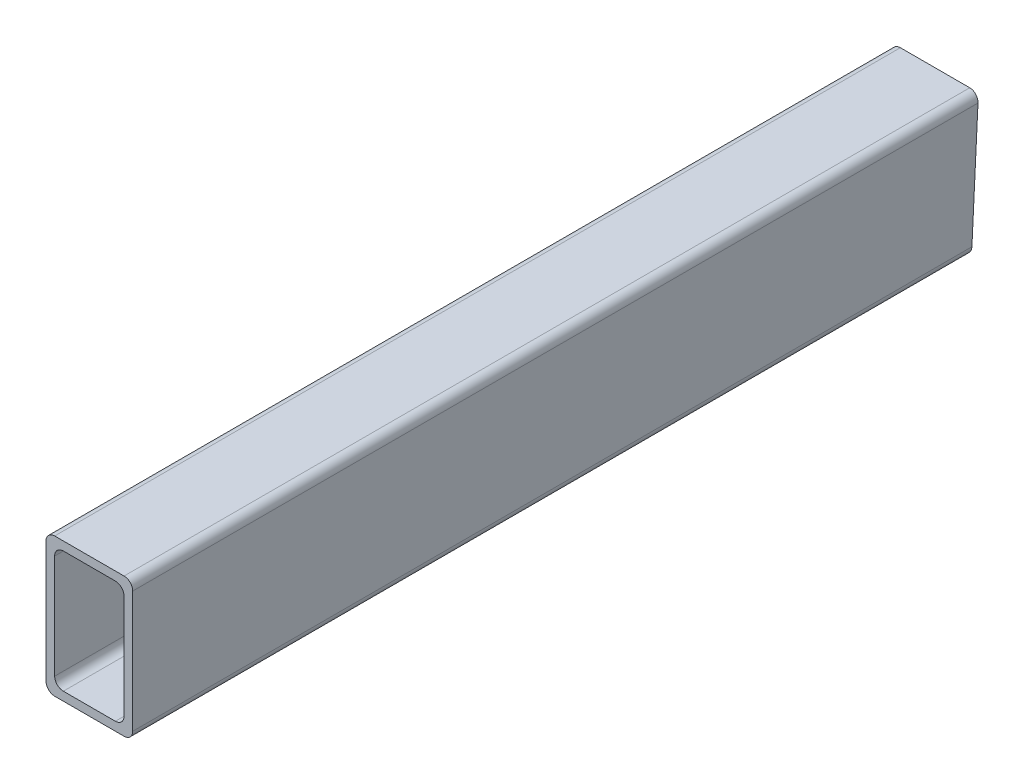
ISO-10303-21;
HEADER;
FILE_DESCRIPTION(('STEP AP214'),'2;1');
FILE_NAME('part.step','',(''),(''),'','','');
FILE_SCHEMA(('AUTOMOTIVE_DESIGN { 1 0 10303 214 1 1 1 1 }'));
ENDSEC;
DATA;
#1=APPLICATION_CONTEXT('core data for automotive mechanical design processes');
#2=APPLICATION_PROTOCOL_DEFINITION('international standard','automotive_design',2000,#1);
#3=PRODUCT_CONTEXT('',#1,'mechanical');
#4=PRODUCT('Part','Part','',(#3));
#5=PRODUCT_RELATED_PRODUCT_CATEGORY('part','',(#4));
#6=PRODUCT_DEFINITION_FORMATION('','',#4);
#7=PRODUCT_DEFINITION_CONTEXT('part definition',#1,'design');
#8=PRODUCT_DEFINITION('design','',#6,#7);
#9=PRODUCT_DEFINITION_SHAPE('','',#8);
#10=(LENGTH_UNIT() NAMED_UNIT(*) SI_UNIT(.MILLI.,.METRE.));
#11=(NAMED_UNIT(*) PLANE_ANGLE_UNIT() SI_UNIT($,.RADIAN.));
#12=(NAMED_UNIT(*) SI_UNIT($,.STERADIAN.) SOLID_ANGLE_UNIT());
#13=UNCERTAINTY_MEASURE_WITH_UNIT(LENGTH_MEASURE(1.E-05),#10,'distance_accuracy_value','');
#14=(GEOMETRIC_REPRESENTATION_CONTEXT(3) GLOBAL_UNCERTAINTY_ASSIGNED_CONTEXT((#13)) GLOBAL_UNIT_ASSIGNED_CONTEXT((#10,
#11,#12)) REPRESENTATION_CONTEXT('',''));
#15=CARTESIAN_POINT('',(0.,0.,0.));
#16=DIRECTION('',(0.,0.,1.));
#17=DIRECTION('',(1.,0.,0.));
#18=AXIS2_PLACEMENT_3D('',#15,#16,#17);
#19=CARTESIAN_POINT('',(-25.,40.,10500.));
#20=DIRECTION('',(1.,0.,0.));
#21=DIRECTION('',(0.,1.,0.));
#22=AXIS2_PLACEMENT_3D('',#19,#20,#21);
#23=PLANE('',#22);
#24=DIRECTION('',(0.,0.998752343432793,-0.0499375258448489));
#25=VECTOR('',#24,1.);
#26=CARTESIAN_POINT('',(-25.,15.6853310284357,10013.7057312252));
#27=LINE('',#26,#25);
#28=CARTESIAN_POINT('',(-25.,-35.,10016.2399931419));
#29=VERTEX_POINT('',#28);
#30=CARTESIAN_POINT('',(-25.,35.,10012.7399995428));
#31=VERTEX_POINT('',#30);
#32=EDGE_CURVE('E156',#29,#31,#27,.T.);
#33=ORIENTED_EDGE('',*,*,#32,.F.);
#34=DIRECTION('',(0.,0.,-1.));
#35=VECTOR('',#34,1.);
#36=CARTESIAN_POINT('',(-25.,-35.,10500.));
#37=LINE('',#36,#35);
#38=CARTESIAN_POINT('',(-25.,-35.,10500.));
#39=VERTEX_POINT('',#38);
#40=EDGE_CURVE('E214',#29,#39,#37,.F.);
#41=ORIENTED_EDGE('',*,*,#40,.T.);
#42=DIRECTION('',(0.,-1.,0.));
#43=VECTOR('',#42,1.);
#44=CARTESIAN_POINT('',(-25.,40.,10500.));
#45=LINE('',#44,#43);
#46=CARTESIAN_POINT('',(-25.,35.,10500.));
#47=VERTEX_POINT('',#46);
#48=EDGE_CURVE('E202',#47,#39,#45,.T.);
#49=ORIENTED_EDGE('',*,*,#48,.F.);
#50=DIRECTION('',(0.,0.,-1.));
#51=VECTOR('',#50,1.);
#52=CARTESIAN_POINT('',(-25.,35.,10500.));
#53=LINE('',#52,#51);
#54=EDGE_CURVE('E216',#47,#31,#53,.T.);
#55=ORIENTED_EDGE('',*,*,#54,.T.);
#56=EDGE_LOOP('',(#33,#41,#49,#55));
#57=FACE_BOUND('',#56,.T.);
#58=ADVANCED_FACE('F33',(#57),#23,.F.);
#59=CARTESIAN_POINT('',(-25.,-40.,10500.));
#60=DIRECTION('',(0.,1.,0.));
#61=DIRECTION('',(-1.,0.,0.));
#62=AXIS2_PLACEMENT_3D('',#59,#60,#61);
#63=PLANE('',#62);
#64=DIRECTION('',(-1.,0.,0.));
#65=VECTOR('',#64,1.);
#66=CARTESIAN_POINT('',(-25.,-40.,10016.4899926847));
#67=LINE('',#66,#65);
#68=CARTESIAN_POINT('',(20.,-40.,10016.4899926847));
#69=VERTEX_POINT('',#68);
#70=CARTESIAN_POINT('',(-20.,-40.,10016.4899926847));
#71=VERTEX_POINT('',#70);
#72=EDGE_CURVE('E279',#69,#71,#67,.T.);
#73=ORIENTED_EDGE('',*,*,#72,.F.);
#74=DIRECTION('',(0.,0.,-1.));
#75=VECTOR('',#74,1.);
#76=CARTESIAN_POINT('',(20.,-40.,10500.));
#77=LINE('',#76,#75);
#78=CARTESIAN_POINT('',(20.,-40.,10500.));
#79=VERTEX_POINT('',#78);
#80=EDGE_CURVE('E235',#69,#79,#77,.F.);
#81=ORIENTED_EDGE('',*,*,#80,.T.);
#82=DIRECTION('',(1.,0.,0.));
#83=VECTOR('',#82,1.);
#84=CARTESIAN_POINT('',(-25.,-40.,10500.));
#85=LINE('',#84,#83);
#86=CARTESIAN_POINT('',(-20.,-40.,10500.));
#87=VERTEX_POINT('',#86);
#88=EDGE_CURVE('E248',#87,#79,#85,.T.);
#89=ORIENTED_EDGE('',*,*,#88,.F.);
#90=DIRECTION('',(0.,0.,-1.));
#91=VECTOR('',#90,1.);
#92=CARTESIAN_POINT('',(-20.,-40.,10500.));
#93=LINE('',#92,#91);
#94=EDGE_CURVE('E237',#87,#71,#93,.T.);
#95=ORIENTED_EDGE('',*,*,#94,.T.);
#96=EDGE_LOOP('',(#73,#81,#89,#95));
#97=FACE_BOUND('',#96,.T.);
#98=ADVANCED_FACE('F299',(#97),#63,.F.);
#99=CARTESIAN_POINT('',(25.,40.,10500.));
#100=DIRECTION('',(-1.,0.,0.));
#101=DIRECTION('',(0.,-1.,0.));
#102=AXIS2_PLACEMENT_3D('',#99,#100,#101);
#103=PLANE('',#102);
#104=DIRECTION('',(0.,-0.998752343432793,0.0499375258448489));
#105=VECTOR('',#104,1.);
#106=CARTESIAN_POINT('',(25.,15.6853310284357,10013.7057312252));
#107=LINE('',#106,#105);
#108=CARTESIAN_POINT('',(25.,35.,10012.7399995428));
#109=VERTEX_POINT('',#108);
#110=CARTESIAN_POINT('',(25.,-35.,10016.2399931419));
#111=VERTEX_POINT('',#110);
#112=EDGE_CURVE('E166',#109,#111,#107,.T.);
#113=ORIENTED_EDGE('',*,*,#112,.F.);
#114=DIRECTION('',(0.,0.,-1.));
#115=VECTOR('',#114,1.);
#116=CARTESIAN_POINT('',(25.,35.,10500.));
#117=LINE('',#116,#115);
#118=CARTESIAN_POINT('',(25.,35.,10500.));
#119=VERTEX_POINT('',#118);
#120=EDGE_CURVE('E164',#109,#119,#117,.F.);
#121=ORIENTED_EDGE('',*,*,#120,.T.);
#122=DIRECTION('',(0.,1.,0.));
#123=VECTOR('',#122,1.);
#124=CARTESIAN_POINT('',(25.,40.,10500.));
#125=LINE('',#124,#123);
#126=CARTESIAN_POINT('',(25.,-35.,10500.));
#127=VERTEX_POINT('',#126);
#128=EDGE_CURVE('E245',#127,#119,#125,.T.);
#129=ORIENTED_EDGE('',*,*,#128,.F.);
#130=DIRECTION('',(0.,0.,-1.));
#131=VECTOR('',#130,1.);
#132=CARTESIAN_POINT('',(25.,-35.,10500.));
#133=LINE('',#132,#131);
#134=EDGE_CURVE('E240',#127,#111,#133,.T.);
#135=ORIENTED_EDGE('',*,*,#134,.T.);
#136=EDGE_LOOP('',(#113,#121,#129,#135));
#137=FACE_BOUND('',#136,.T.);
#138=ADVANCED_FACE('F307',(#137),#103,.F.);
#139=CARTESIAN_POINT('',(-25.,40.,10500.));
#140=DIRECTION('',(0.,-1.,0.));
#141=DIRECTION('',(0.,0.,-1.));
#142=AXIS2_PLACEMENT_3D('',#139,#140,#141);
#143=PLANE('',#142);
#144=DIRECTION('',(-1.,0.,0.));
#145=VECTOR('',#144,1.);
#146=CARTESIAN_POINT('',(13156.7797512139,40.0000000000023,10012.49));
#147=LINE('',#146,#145);
#148=CARTESIAN_POINT('',(20.,40.,10012.49));
#149=VERTEX_POINT('',#148);
#150=CARTESIAN_POINT('',(-20.,40.,10012.49));
#151=VERTEX_POINT('',#150);
#152=EDGE_CURVE('E147',#149,#151,#147,.T.);
#153=ORIENTED_EDGE('',*,*,#152,.T.);
#154=DIRECTION('',(0.,0.,-1.));
#155=VECTOR('',#154,1.);
#156=CARTESIAN_POINT('',(-20.,40.,10500.));
#157=LINE('',#156,#155);
#158=CARTESIAN_POINT('',(-20.,40.,10500.));
#159=VERTEX_POINT('',#158);
#160=EDGE_CURVE('E173',#151,#159,#157,.F.);
#161=ORIENTED_EDGE('',*,*,#160,.T.);
#162=DIRECTION('',(-1.,0.,0.));
#163=VECTOR('',#162,1.);
#164=CARTESIAN_POINT('',(-25.,40.,10500.));
#165=LINE('',#164,#163);
#166=CARTESIAN_POINT('',(20.,40.,10500.));
#167=VERTEX_POINT('',#166);
#168=EDGE_CURVE('E171',#167,#159,#165,.T.);
#169=ORIENTED_EDGE('',*,*,#168,.F.);
#170=DIRECTION('',(0.,0.,-1.));
#171=VECTOR('',#170,1.);
#172=CARTESIAN_POINT('',(20.,40.,10500.));
#173=LINE('',#172,#171);
#174=EDGE_CURVE('E163',#167,#149,#173,.T.);
#175=ORIENTED_EDGE('',*,*,#174,.T.);
#176=EDGE_LOOP('',(#153,#161,#169,#175));
#177=FACE_BOUND('',#176,.T.);
#178=ADVANCED_FACE('F169',(#177),#143,.F.);
#179=CARTESIAN_POINT('',(-20.,35.,10500.));
#180=DIRECTION('',(1.,0.,0.));
#181=DIRECTION('',(0.,1.,0.));
#182=AXIS2_PLACEMENT_3D('',#179,#180,#181);
#183=PLANE('',#182);
#184=DIRECTION('',(0.,0.,-1.));
#185=VECTOR('',#184,1.);
#186=CARTESIAN_POINT('',(-20.,-30.,0.));
#187=LINE('',#186,#185);
#188=CARTESIAN_POINT('',(-20.,-30.,10500.));
#189=VERTEX_POINT('',#188);
#190=CARTESIAN_POINT('',(-20.,-30.,10015.9899935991));
#191=VERTEX_POINT('',#190);
#192=EDGE_CURVE('E207',#189,#191,#187,.T.);
#193=ORIENTED_EDGE('',*,*,#192,.T.);
#194=DIRECTION('',(0.,0.998752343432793,-0.0499375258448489));
#195=VECTOR('',#194,1.);
#196=CARTESIAN_POINT('',(-20.,10.6977998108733,10013.95510733));
#197=LINE('',#196,#195);
#198=CARTESIAN_POINT('',(-20.,30.,10012.9899990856));
#199=VERTEX_POINT('',#198);
#200=EDGE_CURVE('E269',#191,#199,#197,.T.);
#201=ORIENTED_EDGE('',*,*,#200,.T.);
#202=DIRECTION('',(0.,0.,-1.));
#203=VECTOR('',#202,1.);
#204=CARTESIAN_POINT('',(-20.,30.,10500.));
#205=LINE('',#204,#203);
#206=CARTESIAN_POINT('',(-20.,30.,10500.));
#207=VERTEX_POINT('',#206);
#208=EDGE_CURVE('E210',#199,#207,#205,.F.);
#209=ORIENTED_EDGE('',*,*,#208,.T.);
#210=DIRECTION('',(0.,-1.,0.));
#211=VECTOR('',#210,1.);
#212=CARTESIAN_POINT('',(-20.,35.,10500.));
#213=LINE('',#212,#211);
#214=EDGE_CURVE('E193',#207,#189,#213,.T.);
#215=ORIENTED_EDGE('',*,*,#214,.T.);
#216=EDGE_LOOP('',(#193,#201,#209,#215));
#217=FACE_BOUND('',#216,.T.);
#218=ADVANCED_FACE('F314',(#217),#183,.T.);
#219=CARTESIAN_POINT('',(-20.,-35.,10500.));
#220=DIRECTION('',(0.,1.,0.));
#221=DIRECTION('',(0.,0.,1.));
#222=AXIS2_PLACEMENT_3D('',#219,#220,#221);
#223=PLANE('',#222);
#224=DIRECTION('',(0.,0.,-1.));
#225=VECTOR('',#224,1.);
#226=CARTESIAN_POINT('',(15.,-35.,0.));
#227=LINE('',#226,#225);
#228=CARTESIAN_POINT('',(15.,-35.,10500.));
#229=VERTEX_POINT('',#228);
#230=CARTESIAN_POINT('',(15.,-35.,10016.2399931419));
#231=VERTEX_POINT('',#230);
#232=EDGE_CURVE('E223',#229,#231,#227,.T.);
#233=ORIENTED_EDGE('',*,*,#232,.T.);
#234=DIRECTION('',(-1.,0.,0.));
#235=VECTOR('',#234,1.);
#236=CARTESIAN_POINT('',(-20.,-35.,10016.2399931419));
#237=LINE('',#236,#235);
#238=CARTESIAN_POINT('',(-15.,-35.,10016.2399931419));
#239=VERTEX_POINT('',#238);
#240=EDGE_CURVE('E260',#231,#239,#237,.T.);
#241=ORIENTED_EDGE('',*,*,#240,.T.);
#242=DIRECTION('',(0.,0.,-1.));
#243=VECTOR('',#242,1.);
#244=CARTESIAN_POINT('',(-15.,-35.,10500.));
#245=LINE('',#244,#243);
#246=CARTESIAN_POINT('',(-15.,-35.,10500.));
#247=VERTEX_POINT('',#246);
#248=EDGE_CURVE('E225',#239,#247,#245,.F.);
#249=ORIENTED_EDGE('',*,*,#248,.T.);
#250=DIRECTION('',(1.,0.,0.));
#251=VECTOR('',#250,1.);
#252=CARTESIAN_POINT('',(-20.,-35.,10500.));
#253=LINE('',#252,#251);
#254=EDGE_CURVE('E255',#247,#229,#253,.T.);
#255=ORIENTED_EDGE('',*,*,#254,.T.);
#256=EDGE_LOOP('',(#233,#241,#249,#255));
#257=FACE_BOUND('',#256,.T.);
#258=ADVANCED_FACE('F353',(#257),#223,.T.);
#259=CARTESIAN_POINT('',(20.,35.,10500.));
#260=DIRECTION('',(-1.,0.,0.));
#261=DIRECTION('',(0.,-1.,0.));
#262=AXIS2_PLACEMENT_3D('',#259,#260,#261);
#263=PLANE('',#262);
#264=DIRECTION('',(0.,0.,-1.));
#265=VECTOR('',#264,1.);
#266=CARTESIAN_POINT('',(20.,30.,0.));
#267=LINE('',#266,#265);
#268=CARTESIAN_POINT('',(20.,30.,10500.));
#269=VERTEX_POINT('',#268);
#270=CARTESIAN_POINT('',(20.,30.,10012.9899990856));
#271=VERTEX_POINT('',#270);
#272=EDGE_CURVE('E221',#269,#271,#267,.T.);
#273=ORIENTED_EDGE('',*,*,#272,.T.);
#274=DIRECTION('',(0.,-0.998752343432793,0.0499375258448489));
#275=VECTOR('',#274,1.);
#276=CARTESIAN_POINT('',(20.,10.6977998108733,10013.95510733));
#277=LINE('',#276,#275);
#278=CARTESIAN_POINT('',(20.,-30.,10015.9899935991));
#279=VERTEX_POINT('',#278);
#280=EDGE_CURVE('E56',#271,#279,#277,.T.);
#281=ORIENTED_EDGE('',*,*,#280,.T.);
#282=DIRECTION('',(0.,0.,-1.));
#283=VECTOR('',#282,1.);
#284=CARTESIAN_POINT('',(20.,-30.,10500.));
#285=LINE('',#284,#283);
#286=CARTESIAN_POINT('',(20.,-30.,10500.));
#287=VERTEX_POINT('',#286);
#288=EDGE_CURVE('E219',#279,#287,#285,.F.);
#289=ORIENTED_EDGE('',*,*,#288,.T.);
#290=DIRECTION('',(0.,1.,0.));
#291=VECTOR('',#290,1.);
#292=CARTESIAN_POINT('',(20.,35.,10500.));
#293=LINE('',#292,#291);
#294=EDGE_CURVE('E203',#287,#269,#293,.T.);
#295=ORIENTED_EDGE('',*,*,#294,.T.);
#296=EDGE_LOOP('',(#273,#281,#289,#295));
#297=FACE_BOUND('',#296,.T.);
#298=ADVANCED_FACE('F357',(#297),#263,.T.);
#299=CARTESIAN_POINT('',(-20.,35.,10500.));
#300=DIRECTION('',(0.,-1.,0.));
#301=DIRECTION('',(0.,0.,-1.));
#302=AXIS2_PLACEMENT_3D('',#299,#300,#301);
#303=PLANE('',#302);
#304=DIRECTION('',(0.,0.,-1.));
#305=VECTOR('',#304,1.);
#306=CARTESIAN_POINT('',(-15.,35.,0.));
#307=LINE('',#306,#305);
#308=CARTESIAN_POINT('',(-15.,35.,10500.));
#309=VERTEX_POINT('',#308);
#310=CARTESIAN_POINT('',(-15.,35.,10012.7399995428));
#311=VERTEX_POINT('',#310);
#312=EDGE_CURVE('E199',#309,#311,#307,.T.);
#313=ORIENTED_EDGE('',*,*,#312,.T.);
#314=DIRECTION('',(1.,0.,0.));
#315=VECTOR('',#314,1.);
#316=CARTESIAN_POINT('',(-20.,35.,10012.7399995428));
#317=LINE('',#316,#315);
#318=CARTESIAN_POINT('',(15.,35.,10012.7399995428));
#319=VERTEX_POINT('',#318);
#320=EDGE_CURVE('E272',#311,#319,#317,.T.);
#321=ORIENTED_EDGE('',*,*,#320,.T.);
#322=DIRECTION('',(0.,0.,-1.));
#323=VECTOR('',#322,1.);
#324=CARTESIAN_POINT('',(15.,35.,10500.));
#325=LINE('',#324,#323);
#326=CARTESIAN_POINT('',(15.,35.,10500.));
#327=VERTEX_POINT('',#326);
#328=EDGE_CURVE('E177',#319,#327,#325,.F.);
#329=ORIENTED_EDGE('',*,*,#328,.T.);
#330=DIRECTION('',(-1.,0.,0.));
#331=VECTOR('',#330,1.);
#332=CARTESIAN_POINT('',(-20.,35.,10500.));
#333=LINE('',#332,#331);
#334=EDGE_CURVE('E190',#327,#309,#333,.T.);
#335=ORIENTED_EDGE('',*,*,#334,.T.);
#336=EDGE_LOOP('',(#313,#321,#329,#335));
#337=FACE_BOUND('',#336,.T.);
#338=ADVANCED_FACE('F198',(#337),#303,.T.);
#339=CARTESIAN_POINT('',(20.,-35.,10500.));
#340=DIRECTION('',(0.,0.,-1.));
#341=DIRECTION('',(-1.,0.,0.));
#342=AXIS2_PLACEMENT_3D('',#339,#340,#341);
#343=CYLINDRICAL_SURFACE('',#342,5.);
#344=ORIENTED_EDGE('',*,*,#80,.F.);
#345=CARTESIAN_POINT('',(20.,-35.,10016.2399931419));
#346=DIRECTION('',(0.,-0.0499375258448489,-0.998752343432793));
#347=DIRECTION('',(0.,0.998752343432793,-0.0499375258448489));
#348=AXIS2_PLACEMENT_3D('',#345,#346,#347);
#349=ELLIPSE('',#348,5.00624607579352,5.);
#350=EDGE_CURVE('E276',#69,#111,#349,.F.);
#351=ORIENTED_EDGE('',*,*,#350,.T.);
#352=ORIENTED_EDGE('',*,*,#134,.F.);
#353=CARTESIAN_POINT('',(20.,-35.,10500.));
#354=DIRECTION('',(0.,0.,1.));
#355=DIRECTION('',(1.,0.,0.));
#356=AXIS2_PLACEMENT_3D('',#353,#354,#355);
#357=CIRCLE('',#356,5.);
#358=EDGE_CURVE('E227',#79,#127,#357,.T.);
#359=ORIENTED_EDGE('',*,*,#358,.F.);
#360=EDGE_LOOP('',(#344,#351,#352,#359));
#361=FACE_BOUND('',#360,.T.);
#362=ADVANCED_FACE('F305',(#361),#343,.T.);
#363=CARTESIAN_POINT('',(15.,-30.,10500.));
#364=DIRECTION('',(0.,0.,1.));
#365=DIRECTION('',(1.,0.,0.));
#366=AXIS2_PLACEMENT_3D('',#363,#364,#365);
#367=CYLINDRICAL_SURFACE('',#366,5.);
#368=CARTESIAN_POINT('',(15.,-30.,10015.9899935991));
#369=DIRECTION('',(0.,-0.0499375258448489,-0.998752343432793));
#370=DIRECTION('',(0.,-0.998752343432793,0.0499375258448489));
#371=AXIS2_PLACEMENT_3D('',#368,#369,#370);
#372=ELLIPSE('',#371,5.00624607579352,5.);
#373=EDGE_CURVE('E48',#231,#279,#372,.F.);
#374=ORIENTED_EDGE('',*,*,#373,.F.);
#375=ORIENTED_EDGE('',*,*,#232,.F.);
#376=CARTESIAN_POINT('',(15.,-30.,10500.));
#377=DIRECTION('',(0.,0.,1.));
#378=DIRECTION('',(1.,0.,0.));
#379=AXIS2_PLACEMENT_3D('',#376,#377,#378);
#380=CIRCLE('',#379,5.);
#381=EDGE_CURVE('E172',#287,#229,#380,.F.);
#382=ORIENTED_EDGE('',*,*,#381,.F.);
#383=ORIENTED_EDGE('',*,*,#288,.F.);
#384=EDGE_LOOP('',(#374,#375,#382,#383));
#385=FACE_BOUND('',#384,.T.);
#386=ADVANCED_FACE('F324',(#385),#367,.F.);
#387=CARTESIAN_POINT('',(-20.,-35.,10500.));
#388=DIRECTION('',(0.,0.,-1.));
#389=DIRECTION('',(-1.,0.,0.));
#390=AXIS2_PLACEMENT_3D('',#387,#388,#389);
#391=CYLINDRICAL_SURFACE('',#390,5.);
#392=ORIENTED_EDGE('',*,*,#40,.F.);
#393=CARTESIAN_POINT('',(-20.,-35.,10016.2399931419));
#394=DIRECTION('',(0.,-0.0499375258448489,-0.998752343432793));
#395=DIRECTION('',(0.,0.998752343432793,-0.0499375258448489));
#396=AXIS2_PLACEMENT_3D('',#393,#394,#395);
#397=ELLIPSE('',#396,5.00624607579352,5.);
#398=EDGE_CURVE('E281',#29,#71,#397,.F.);
#399=ORIENTED_EDGE('',*,*,#398,.T.);
#400=ORIENTED_EDGE('',*,*,#94,.F.);
#401=CARTESIAN_POINT('',(-20.,-35.,10500.));
#402=DIRECTION('',(0.,0.,1.));
#403=DIRECTION('',(1.,0.,0.));
#404=AXIS2_PLACEMENT_3D('',#401,#402,#403);
#405=CIRCLE('',#404,5.);
#406=EDGE_CURVE('E229',#39,#87,#405,.T.);
#407=ORIENTED_EDGE('',*,*,#406,.F.);
#408=EDGE_LOOP('',(#392,#399,#400,#407));
#409=FACE_BOUND('',#408,.T.);
#410=ADVANCED_FACE('F296',(#409),#391,.T.);
#411=CARTESIAN_POINT('',(-15.,-30.,10500.));
#412=DIRECTION('',(0.,0.,1.));
#413=DIRECTION('',(1.,0.,0.));
#414=AXIS2_PLACEMENT_3D('',#411,#412,#413);
#415=CYLINDRICAL_SURFACE('',#414,5.);
#416=CARTESIAN_POINT('',(-15.,-30.,10015.9899935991));
#417=DIRECTION('',(0.,-0.0499375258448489,-0.998752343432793));
#418=DIRECTION('',(0.,-0.998752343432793,0.0499375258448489));
#419=AXIS2_PLACEMENT_3D('',#416,#417,#418);
#420=ELLIPSE('',#419,5.00624607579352,5.);
#421=EDGE_CURVE('E263',#191,#239,#420,.F.);
#422=ORIENTED_EDGE('',*,*,#421,.F.);
#423=ORIENTED_EDGE('',*,*,#192,.F.);
#424=CARTESIAN_POINT('',(-15.,-30.,10500.));
#425=DIRECTION('',(0.,0.,1.));
#426=DIRECTION('',(1.,0.,0.));
#427=AXIS2_PLACEMENT_3D('',#424,#425,#426);
#428=CIRCLE('',#427,5.);
#429=EDGE_CURVE('E175',#247,#189,#428,.F.);
#430=ORIENTED_EDGE('',*,*,#429,.F.);
#431=ORIENTED_EDGE('',*,*,#248,.F.);
#432=EDGE_LOOP('',(#422,#423,#430,#431));
#433=FACE_BOUND('',#432,.T.);
#434=ADVANCED_FACE('F329',(#433),#415,.F.);
#435=CARTESIAN_POINT('',(15.,30.,10500.));
#436=DIRECTION('',(0.,0.,1.));
#437=DIRECTION('',(1.,0.,0.));
#438=AXIS2_PLACEMENT_3D('',#435,#436,#437);
#439=CYLINDRICAL_SURFACE('',#438,5.);
#440=CARTESIAN_POINT('',(15.,30.,10012.9899990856));
#441=DIRECTION('',(0.,-0.0499375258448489,-0.998752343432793));
#442=DIRECTION('',(0.,-0.998752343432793,0.0499375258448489));
#443=AXIS2_PLACEMENT_3D('',#440,#441,#442);
#444=ELLIPSE('',#443,5.00624607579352,5.);
#445=EDGE_CURVE('E266',#271,#319,#444,.F.);
#446=ORIENTED_EDGE('',*,*,#445,.F.);
#447=ORIENTED_EDGE('',*,*,#272,.F.);
#448=CARTESIAN_POINT('',(15.,30.,10500.));
#449=DIRECTION('',(0.,0.,1.));
#450=DIRECTION('',(1.,0.,0.));
#451=AXIS2_PLACEMENT_3D('',#448,#449,#450);
#452=CIRCLE('',#451,5.);
#453=EDGE_CURVE('E182',#327,#269,#452,.F.);
#454=ORIENTED_EDGE('',*,*,#453,.F.);
#455=ORIENTED_EDGE('',*,*,#328,.F.);
#456=EDGE_LOOP('',(#446,#447,#454,#455));
#457=FACE_BOUND('',#456,.T.);
#458=ADVANCED_FACE('F332',(#457),#439,.F.);
#459=CARTESIAN_POINT('',(20.,35.,10500.));
#460=DIRECTION('',(0.,0.,-1.));
#461=DIRECTION('',(-1.,0.,0.));
#462=AXIS2_PLACEMENT_3D('',#459,#460,#461);
#463=CYLINDRICAL_SURFACE('',#462,5.);
#464=ORIENTED_EDGE('',*,*,#120,.F.);
#465=CARTESIAN_POINT('',(20.,35.,10012.7399995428));
#466=DIRECTION('',(0.,-0.0499375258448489,-0.998752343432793));
#467=DIRECTION('',(0.,0.998752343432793,-0.0499375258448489));
#468=AXIS2_PLACEMENT_3D('',#465,#466,#467);
#469=ELLIPSE('',#468,5.00624607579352,5.);
#470=EDGE_CURVE('E151',#109,#149,#469,.F.);
#471=ORIENTED_EDGE('',*,*,#470,.T.);
#472=ORIENTED_EDGE('',*,*,#174,.F.);
#473=CARTESIAN_POINT('',(20.,35.,10500.));
#474=DIRECTION('',(0.,0.,1.));
#475=DIRECTION('',(1.,0.,0.));
#476=AXIS2_PLACEMENT_3D('',#473,#474,#475);
#477=CIRCLE('',#476,5.);
#478=EDGE_CURVE('E231',#119,#167,#477,.T.);
#479=ORIENTED_EDGE('',*,*,#478,.F.);
#480=EDGE_LOOP('',(#464,#471,#472,#479));
#481=FACE_BOUND('',#480,.T.);
#482=ADVANCED_FACE('F161',(#481),#463,.T.);
#483=CARTESIAN_POINT('',(-15.,30.,10500.));
#484=DIRECTION('',(0.,0.,1.));
#485=DIRECTION('',(1.,0.,0.));
#486=AXIS2_PLACEMENT_3D('',#483,#484,#485);
#487=CYLINDRICAL_SURFACE('',#486,5.);
#488=CARTESIAN_POINT('',(-15.,30.,10012.9899990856));
#489=DIRECTION('',(0.,-0.0499375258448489,-0.998752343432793));
#490=DIRECTION('',(0.,-0.998752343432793,0.0499375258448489));
#491=AXIS2_PLACEMENT_3D('',#488,#489,#490);
#492=ELLIPSE('',#491,5.00624607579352,5.);
#493=EDGE_CURVE('E165',#311,#199,#492,.F.);
#494=ORIENTED_EDGE('',*,*,#493,.F.);
#495=ORIENTED_EDGE('',*,*,#312,.F.);
#496=CARTESIAN_POINT('',(-15.,30.,10500.));
#497=DIRECTION('',(0.,0.,1.));
#498=DIRECTION('',(1.,0.,0.));
#499=AXIS2_PLACEMENT_3D('',#496,#497,#498);
#500=CIRCLE('',#499,5.);
#501=EDGE_CURVE('E41',#207,#309,#500,.F.);
#502=ORIENTED_EDGE('',*,*,#501,.F.);
#503=ORIENTED_EDGE('',*,*,#208,.F.);
#504=EDGE_LOOP('',(#494,#495,#502,#503));
#505=FACE_BOUND('',#504,.T.);
#506=ADVANCED_FACE('F205',(#505),#487,.F.);
#507=CARTESIAN_POINT('',(-20.,35.,10500.));
#508=DIRECTION('',(0.,0.,-1.));
#509=DIRECTION('',(-1.,0.,0.));
#510=AXIS2_PLACEMENT_3D('',#507,#508,#509);
#511=CYLINDRICAL_SURFACE('',#510,5.);
#512=ORIENTED_EDGE('',*,*,#160,.F.);
#513=CARTESIAN_POINT('',(-20.,35.,10012.7399995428));
#514=DIRECTION('',(0.,-0.0499375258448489,-0.998752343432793));
#515=DIRECTION('',(0.,0.998752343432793,-0.0499375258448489));
#516=AXIS2_PLACEMENT_3D('',#513,#514,#515);
#517=ELLIPSE('',#516,5.00624607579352,5.);
#518=EDGE_CURVE('E11',#151,#31,#517,.F.);
#519=ORIENTED_EDGE('',*,*,#518,.T.);
#520=ORIENTED_EDGE('',*,*,#54,.F.);
#521=CARTESIAN_POINT('',(-20.,35.,10500.));
#522=DIRECTION('',(0.,0.,1.));
#523=DIRECTION('',(1.,0.,0.));
#524=AXIS2_PLACEMENT_3D('',#521,#522,#523);
#525=CIRCLE('',#524,5.);
#526=EDGE_CURVE('E233',#159,#47,#525,.T.);
#527=ORIENTED_EDGE('',*,*,#526,.F.);
#528=EDGE_LOOP('',(#512,#519,#520,#527));
#529=FACE_BOUND('',#528,.T.);
#530=ADVANCED_FACE('F35',(#529),#511,.T.);
#531=CARTESIAN_POINT('',(-25.,-40.,10500.));
#532=DIRECTION('',(0.,0.,1.));
#533=DIRECTION('',(1.,0.,0.));
#534=AXIS2_PLACEMENT_3D('',#531,#532,#533);
#535=PLANE('',#534);
#536=ORIENTED_EDGE('',*,*,#88,.T.);
#537=ORIENTED_EDGE('',*,*,#358,.T.);
#538=ORIENTED_EDGE('',*,*,#128,.T.);
#539=ORIENTED_EDGE('',*,*,#478,.T.);
#540=ORIENTED_EDGE('',*,*,#168,.T.);
#541=ORIENTED_EDGE('',*,*,#526,.T.);
#542=ORIENTED_EDGE('',*,*,#48,.T.);
#543=ORIENTED_EDGE('',*,*,#406,.T.);
#544=EDGE_LOOP('',(#536,#537,#538,#539,#540,#541,#542,#543));
#545=FACE_BOUND('',#544,.T.);
#546=ORIENTED_EDGE('',*,*,#254,.F.);
#547=ORIENTED_EDGE('',*,*,#429,.T.);
#548=ORIENTED_EDGE('',*,*,#214,.F.);
#549=ORIENTED_EDGE('',*,*,#501,.T.);
#550=ORIENTED_EDGE('',*,*,#334,.F.);
#551=ORIENTED_EDGE('',*,*,#453,.T.);
#552=ORIENTED_EDGE('',*,*,#294,.F.);
#553=ORIENTED_EDGE('',*,*,#381,.T.);
#554=EDGE_LOOP('',(#546,#547,#548,#549,#550,#551,#552,#553));
#555=FACE_BOUND('',#554,.T.);
#556=ADVANCED_FACE('F189',(#545,#555),#535,.T.);
#557=CARTESIAN_POINT('',(13156.7797512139,40.0000000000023,10012.49));
#558=DIRECTION('',(0.,-0.0499375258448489,-0.998752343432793));
#559=DIRECTION('',(0.,0.998752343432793,-0.0499375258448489));
#560=AXIS2_PLACEMENT_3D('',#557,#558,#559);
#561=PLANE('',#560);
#562=ORIENTED_EDGE('',*,*,#470,.F.);
#563=ORIENTED_EDGE('',*,*,#112,.T.);
#564=ORIENTED_EDGE('',*,*,#350,.F.);
#565=ORIENTED_EDGE('',*,*,#72,.T.);
#566=ORIENTED_EDGE('',*,*,#398,.F.);
#567=ORIENTED_EDGE('',*,*,#32,.T.);
#568=ORIENTED_EDGE('',*,*,#518,.F.);
#569=ORIENTED_EDGE('',*,*,#152,.F.);
#570=EDGE_LOOP('',(#562,#563,#564,#565,#566,#567,#568,#569));
#571=FACE_BOUND('',#570,.T.);
#572=ORIENTED_EDGE('',*,*,#240,.F.);
#573=ORIENTED_EDGE('',*,*,#373,.T.);
#574=ORIENTED_EDGE('',*,*,#280,.F.);
#575=ORIENTED_EDGE('',*,*,#445,.T.);
#576=ORIENTED_EDGE('',*,*,#320,.F.);
#577=ORIENTED_EDGE('',*,*,#493,.T.);
#578=ORIENTED_EDGE('',*,*,#200,.F.);
#579=ORIENTED_EDGE('',*,*,#421,.T.);
#580=EDGE_LOOP('',(#572,#573,#574,#575,#576,#577,#578,#579));
#581=FACE_BOUND('',#580,.T.);
#582=ADVANCED_FACE('F149',(#571,#581),#561,.T.);
#583=CLOSED_SHELL('',(#58,#98,#138,#178,#218,#258,#298,#338,#362,#386,#410,#434,#458,#482,#506,
#530,#556,#582));
#584=MANIFOLD_SOLID_BREP('B2',#583);
#585=ADVANCED_BREP_SHAPE_REPRESENTATION('',(#18,#584),#14);
#586=SHAPE_DEFINITION_REPRESENTATION(#9,#585);
ENDSEC;
END-ISO-10303-21;
